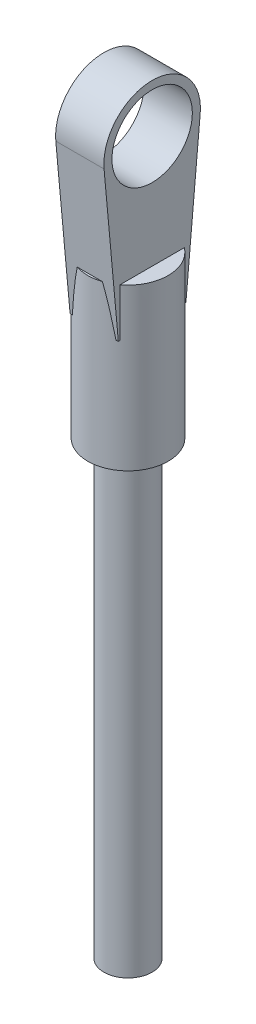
from build123d import *

# Parameters (mm, degrees)
CROQUIS1_R                   = 2.5
SALIENTE_EXTRUIR1_DEPTH      = 10
CROQUIS1_3_R                 = 1.5
SALIENTE_EXTRUIR2_DEPTH      = 28
SALIENTE_EXTRUIR3_DEPTH      = 1.5
SALIENTE_EXTRUIR3_DEPTH_BACK = 1.5
CROQUIS2_R                   = 2.5


with BuildPart() as part:
    # Croquis1 → Saliente-Extruir1 (new body)
    with BuildSketch(Plane(origin=(0, 0, 0), x_dir=(1, 0, 0), z_dir=(0, 1, 0))):
        with Locations(Location((0, 0, 0), (0, 0, 270))):
            Circle(CROQUIS1_R)
    extrude(amount=SALIENTE_EXTRUIR1_DEPTH)

    # Croquis1_3 → Saliente-Extruir2 (add)
    with BuildSketch(Plane(origin=(0, 0, 0), x_dir=(1, 0, 0), z_dir=(0, 1, 0))):
        with Locations(Location((0, 0, 0), (0, 0, 270))):
            Circle(CROQUIS1_3_R)
    extrude(amount=-SALIENTE_EXTRUIR2_DEPTH)

    # Croquis2 → Saliente-Extruir3 (add, two sides: drawn at the far end of the back side and taken through both)
    with BuildSketch(Plane(origin=(0, 0, 0), x_dir=(0, 0, -1), z_dir=(1, 0, 0)).offset(-SALIENTE_EXTRUIR3_DEPTH_BACK)):
        with BuildLine():
            Line((-2.1, 7), (2.1, 7))
            Line((2.1, 7), (2.987588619, 16.72739361))
            ThreePointArc((2.987588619, 16.72739361), (0, 20), (-2.987588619, 16.72739361))
            Line((-2.987588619, 16.72739361), (-2.1, 7))
        make_face()
        with Locations((0, 17)):
            Circle(CROQUIS2_R, mode=Mode.SUBTRACT)
    extrude(amount=SALIENTE_EXTRUIR3_DEPTH + SALIENTE_EXTRUIR3_DEPTH_BACK)


solid = part.part
